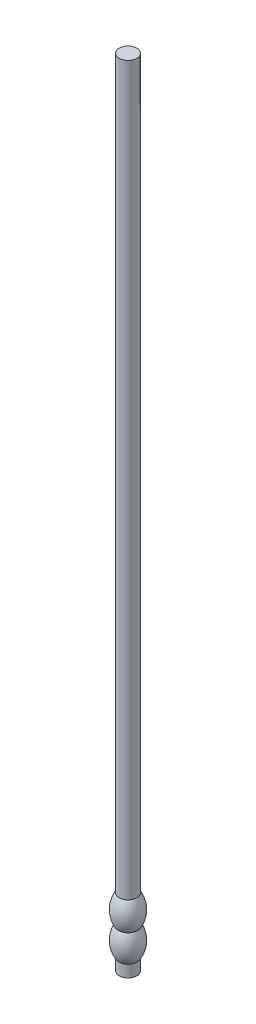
from build123d import *


with BuildPart() as part:
    # Skizze1 → Rotation1 (revolve)
    with BuildSketch(Plane.XY, mode=Mode.PRIVATE) as rotation1_sk:
        with BuildLine():
            Line((0, 0), (10, 0))
            Line((10, 0), (10, 13.416876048))
            ThreePointArc((10, 13.416876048), (14.985545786, 29.068848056), (10.980762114, 45))
            ThreePointArc((10.980762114, 45), (14.985545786, 60.931151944), (10, 76.583123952))
            Line((10, 76.583123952), (10, 900))
            Line((10, 900), (0, 900))
            Line((0, 900), (0, 0))
        make_face()
    revolve(rotation1_sk.sketch.rotate(Axis((0, -15.845418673, 0), (0, 1, 0)), 90), axis=Axis((0, -15.845418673, 0), (0, 1, 0)))


solid = part.part
